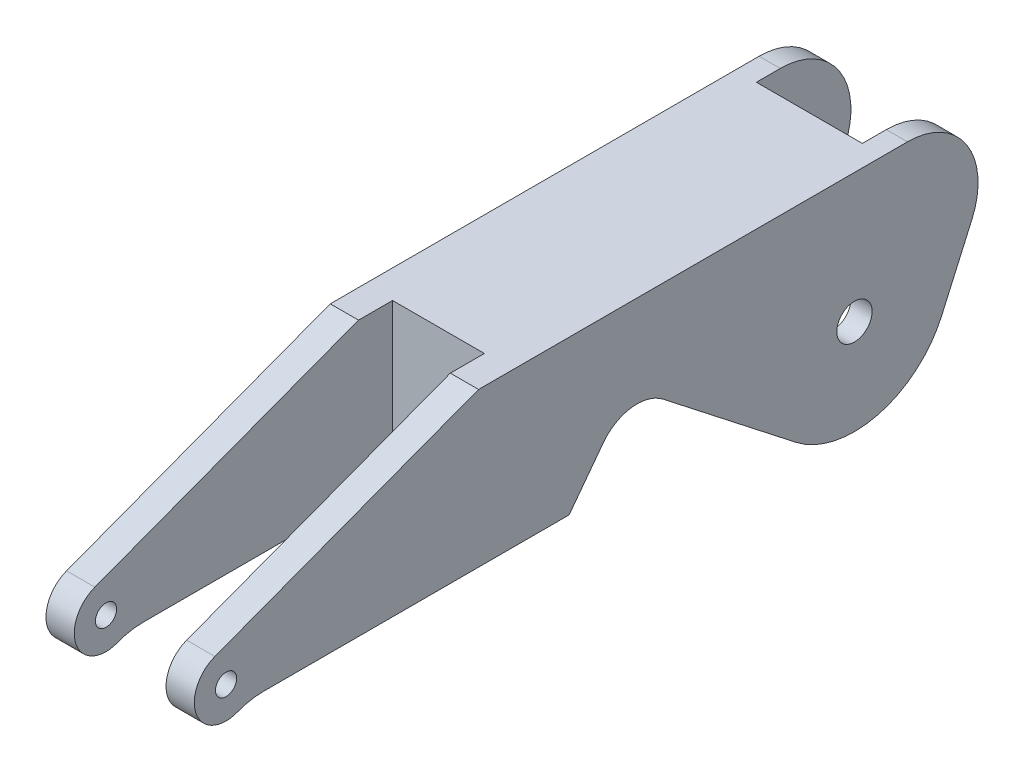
ISO-10303-21;
HEADER;
FILE_DESCRIPTION(('STEP AP214'),'2;1');
FILE_NAME('part.step','',(''),(''),'','','');
FILE_SCHEMA(('AUTOMOTIVE_DESIGN { 1 0 10303 214 1 1 1 1 }'));
ENDSEC;
DATA;
#1=APPLICATION_CONTEXT('core data for automotive mechanical design processes');
#2=APPLICATION_PROTOCOL_DEFINITION('international standard','automotive_design',2000,#1);
#3=PRODUCT_CONTEXT('',#1,'mechanical');
#4=PRODUCT('Part','Part','',(#3));
#5=PRODUCT_RELATED_PRODUCT_CATEGORY('part','',(#4));
#6=PRODUCT_DEFINITION_FORMATION('','',#4);
#7=PRODUCT_DEFINITION_CONTEXT('part definition',#1,'design');
#8=PRODUCT_DEFINITION('design','',#6,#7);
#9=PRODUCT_DEFINITION_SHAPE('','',#8);
#10=(LENGTH_UNIT() NAMED_UNIT(*) SI_UNIT(.MILLI.,.METRE.));
#11=(NAMED_UNIT(*) PLANE_ANGLE_UNIT() SI_UNIT($,.RADIAN.));
#12=(NAMED_UNIT(*) SI_UNIT($,.STERADIAN.) SOLID_ANGLE_UNIT());
#13=UNCERTAINTY_MEASURE_WITH_UNIT(LENGTH_MEASURE(1.E-05),#10,'distance_accuracy_value','');
#14=(GEOMETRIC_REPRESENTATION_CONTEXT(3) GLOBAL_UNCERTAINTY_ASSIGNED_CONTEXT((#13)) GLOBAL_UNIT_ASSIGNED_CONTEXT((#10,
#11,#12)) REPRESENTATION_CONTEXT('',''));
#15=CARTESIAN_POINT('',(0.,0.,0.));
#16=DIRECTION('',(0.,0.,1.));
#17=DIRECTION('',(1.,0.,0.));
#18=AXIS2_PLACEMENT_3D('',#15,#16,#17);
#19=CARTESIAN_POINT('',(105.000000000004,182.960614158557,532.214439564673));
#20=DIRECTION('',(0.,-0.935725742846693,-0.352728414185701));
#21=DIRECTION('',(0.,0.3527284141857,-0.935725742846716));
#22=AXIS2_PLACEMENT_3D('',#19,#20,#21);
#23=PLANE('',#22);
#24=DIRECTION('',(-1.,0.,0.));
#25=VECTOR('',#24,1.);
#26=CARTESIAN_POINT('',(105.000000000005,42.2160562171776,905.584717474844));
#27=LINE('',#26,#25);
#28=CARTESIAN_POINT('',(-64.999999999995,42.2160562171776,905.584717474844));
#29=VERTEX_POINT('',#28);
#30=CARTESIAN_POINT('',(-104.999999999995,42.2160562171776,905.584717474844));
#31=VERTEX_POINT('',#30);
#32=EDGE_CURVE('E386',#29,#31,#27,.T.);
#33=ORIENTED_EDGE('',*,*,#32,.F.);
#34=DIRECTION('',(0.,0.3527284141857,-0.935725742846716));
#35=VECTOR('',#34,1.);
#36=CARTESIAN_POINT('',(-64.9999999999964,182.960614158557,532.214439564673));
#37=LINE('',#36,#35);
#38=CARTESIAN_POINT('',(-64.9999999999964,182.960614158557,532.214439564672));
#39=VERTEX_POINT('',#38);
#40=EDGE_CURVE('E244',#29,#39,#37,.T.);
#41=ORIENTED_EDGE('',*,*,#40,.T.);
#42=DIRECTION('',(-1.,0.,0.));
#43=VECTOR('',#42,1.);
#44=CARTESIAN_POINT('',(105.000000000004,182.960614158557,532.214439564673));
#45=LINE('',#44,#43);
#46=CARTESIAN_POINT('',(-104.999999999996,182.960614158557,532.214439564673));
#47=VERTEX_POINT('',#46);
#48=EDGE_CURVE('E220',#39,#47,#45,.T.);
#49=ORIENTED_EDGE('',*,*,#48,.T.);
#50=DIRECTION('',(0.,-0.3527284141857,0.935725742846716));
#51=VECTOR('',#50,1.);
#52=CARTESIAN_POINT('',(-104.999999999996,182.960614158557,532.214439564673));
#53=LINE('',#52,#51);
#54=EDGE_CURVE('E366',#47,#31,#53,.T.);
#55=ORIENTED_EDGE('',*,*,#54,.T.);
#56=EDGE_LOOP('',(#33,#41,#49,#55));
#57=FACE_BOUND('',#56,.T.);
#58=ADVANCED_FACE('F16',(#57),#23,.F.);
#59=CARTESIAN_POINT('',(105.000000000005,0.100257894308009,889.737756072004));
#60=DIRECTION('',(-1.,0.,0.));
#61=DIRECTION('',(0.,0.,1.));
#62=AXIS2_PLACEMENT_3D('',#59,#60,#61);
#63=CYLINDRICAL_SURFACE('',#62,44.998518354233);
#64=DIRECTION('',(-1.,0.,0.));
#65=VECTOR('',#64,1.);
#66=CARTESIAN_POINT('',(105.000000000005,-41.8965517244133,873.578095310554));
#67=LINE('',#66,#65);
#68=CARTESIAN_POINT('',(-64.999999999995,-41.8965517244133,873.578095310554));
#69=VERTEX_POINT('',#68);
#70=CARTESIAN_POINT('',(-104.999999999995,-41.8965517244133,873.578095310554));
#71=VERTEX_POINT('',#70);
#72=EDGE_CURVE('E382',#69,#71,#67,.T.);
#73=ORIENTED_EDGE('',*,*,#72,.F.);
#74=CARTESIAN_POINT('',(-64.999999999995,0.100257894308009,889.737756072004));
#75=DIRECTION('',(-1.,0.,0.));
#76=DIRECTION('',(0.,0.,1.));
#77=AXIS2_PLACEMENT_3D('',#74,#75,#76);
#78=CIRCLE('',#77,44.998518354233);
#79=EDGE_CURVE('E241',#69,#29,#78,.T.);
#80=ORIENTED_EDGE('',*,*,#79,.T.);
#81=ORIENTED_EDGE('',*,*,#32,.T.);
#82=CARTESIAN_POINT('',(-104.999999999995,0.100257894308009,889.737756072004));
#83=DIRECTION('',(1.,0.,0.));
#84=DIRECTION('',(0.,0.,-1.));
#85=AXIS2_PLACEMENT_3D('',#82,#83,#84);
#86=CIRCLE('',#85,44.998518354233);
#87=EDGE_CURVE('E369',#31,#71,#86,.T.);
#88=ORIENTED_EDGE('',*,*,#87,.T.);
#89=EDGE_LOOP('',(#73,#80,#81,#88));
#90=FACE_BOUND('',#89,.T.);
#91=ADVANCED_FACE('F559',(#90),#63,.T.);
#92=CARTESIAN_POINT('',(105.000000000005,-135.000000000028,837.084973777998));
#93=DIRECTION('',(-1.,0.,0.));
#94=DIRECTION('',(0.,0.,1.));
#95=AXIS2_PLACEMENT_3D('',#92,#93,#94);
#96=CYLINDRICAL_SURFACE('',#95,100.);
#97=DIRECTION('',(-1.,0.,0.));
#98=VECTOR('',#97,1.);
#99=CARTESIAN_POINT('',(105.000000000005,-35.0000000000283,837.084973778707));
#100=LINE('',#99,#98);
#101=CARTESIAN_POINT('',(-64.999999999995,-35.0000000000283,837.084973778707));
#102=VERTEX_POINT('',#101);
#103=CARTESIAN_POINT('',(-104.999999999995,-35.0000000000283,837.084973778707));
#104=VERTEX_POINT('',#103);
#105=EDGE_CURVE('E378',#102,#104,#100,.T.);
#106=ORIENTED_EDGE('',*,*,#105,.F.);
#107=CARTESIAN_POINT('',(-64.999999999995,-135.000000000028,837.084973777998));
#108=DIRECTION('',(-1.,0.,0.));
#109=DIRECTION('',(0.,0.,1.));
#110=AXIS2_PLACEMENT_3D('',#107,#108,#109);
#111=CIRCLE('',#110,100.);
#112=EDGE_CURVE('E238',#102,#69,#111,.F.);
#113=ORIENTED_EDGE('',*,*,#112,.T.);
#114=ORIENTED_EDGE('',*,*,#72,.T.);
#115=CARTESIAN_POINT('',(-104.999999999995,-135.000000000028,837.084973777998));
#116=DIRECTION('',(-1.,0.,0.));
#117=DIRECTION('',(0.,0.,-1.));
#118=AXIS2_PLACEMENT_3D('',#115,#116,#117);
#119=CIRCLE('',#118,100.);
#120=EDGE_CURVE('E372',#71,#104,#119,.T.);
#121=ORIENTED_EDGE('',*,*,#120,.T.);
#122=EDGE_LOOP('',(#106,#113,#114,#121));
#123=FACE_BOUND('',#122,.T.);
#124=ADVANCED_FACE('F565',(#123),#96,.F.);
#125=CARTESIAN_POINT('',(-74.9999999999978,-6.36125925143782,307.291190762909));
#126=DIRECTION('',(1.,0.,0.));
#127=DIRECTION('',(0.,0.,-1.));
#128=AXIS2_PLACEMENT_3D('',#125,#126,#127);
#129=PLANE('',#128);
#130=CARTESIAN_POINT('',(-75.,1.94289029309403E-11,5.27355936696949E-12));
#131=DIRECTION('',(1.,0.,0.));
#132=DIRECTION('',(0.,0.,-1.));
#133=AXIS2_PLACEMENT_3D('',#130,#131,#132);
#134=CIRCLE('',#133,25.);
#135=CARTESIAN_POINT('',(-75.0000000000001,1.94598966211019E-11,-24.9999999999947));
#136=VERTEX_POINT('',#135);
#137=EDGE_CURVE('E221',#136,#136,#134,.T.);
#138=ORIENTED_EDGE('',*,*,#137,.F.);
#139=EDGE_LOOP('',(#138));
#140=FACE_BOUND('',#139,.T.);
#141=CARTESIAN_POINT('',(-74.9999999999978,-6.99586439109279,307.778203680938));
#142=DIRECTION('',(1.,0.,0.));
#143=DIRECTION('',(0.,0.,-1.));
#144=AXIS2_PLACEMENT_3D('',#141,#142,#143);
#145=CIRCLE('',#144,60.);
#146=CARTESIAN_POINT('',(-74.9999999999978,29.849299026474,355.132548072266));
#147=VERTEX_POINT('',#146);
#148=CARTESIAN_POINT('',(-74.9999999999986,40.2903326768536,270.845622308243));
#149=VERTEX_POINT('',#148);
#150=EDGE_CURVE('E319',#147,#149,#145,.F.);
#151=ORIENTED_EDGE('',*,*,#150,.T.);
#152=DIRECTION('',(0.,-0.615661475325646,-0.788010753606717));
#153=VECTOR('',#152,1.);
#154=CARTESIAN_POINT('',(-74.9999999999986,40.2903326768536,270.845622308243));
#155=LINE('',#154,#153);
#156=CARTESIAN_POINT('',(-75.,-106.381451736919,83.1142991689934));
#157=VERTEX_POINT('',#156);
#158=EDGE_CURVE('E317',#149,#157,#155,.T.);
#159=ORIENTED_EDGE('',*,*,#158,.T.);
#160=CARTESIAN_POINT('',(-75.,1.94289029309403E-11,5.27355936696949E-12));
#161=DIRECTION('',(1.,0.,0.));
#162=DIRECTION('',(0.,0.,-1.));
#163=AXIS2_PLACEMENT_3D('',#160,#161,#162);
#164=CIRCLE('',#163,135.000000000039);
#165=CARTESIAN_POINT('',(-75.,-54.7057766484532,-123.419115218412));
#166=VERTEX_POINT('',#165);
#167=EDGE_CURVE('E315',#157,#166,#164,.T.);
#168=ORIENTED_EDGE('',*,*,#167,.T.);
#169=DIRECTION('',(0.,0.914215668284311,-0.405227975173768));
#170=VECTOR('',#169,1.);
#171=CARTESIAN_POINT('',(-75.,-54.7057766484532,-123.419115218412));
#172=LINE('',#171,#170);
#173=CARTESIAN_POINT('',(-75.,42.4378166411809,-166.478212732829));
#174=VERTEX_POINT('',#173);
#175=EDGE_CURVE('E313',#166,#174,#172,.T.);
#176=ORIENTED_EDGE('',*,*,#175,.T.);
#177=CARTESIAN_POINT('',(-75.,82.9606141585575,-75.0566459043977));
#178=DIRECTION('',(1.,0.,0.));
#179=DIRECTION('',(0.,0.,-1.));
#180=AXIS2_PLACEMENT_3D('',#177,#178,#179);
#181=CIRCLE('',#180,100.);
#182=CARTESIAN_POINT('',(-75.,182.960614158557,-75.0566459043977));
#183=VERTEX_POINT('',#182);
#184=EDGE_CURVE('E311',#174,#183,#181,.T.);
#185=ORIENTED_EDGE('',*,*,#184,.T.);
#186=DIRECTION('',(0.,0.,1.));
#187=VECTOR('',#186,1.);
#188=CARTESIAN_POINT('',(-75.,182.960614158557,-75.0566459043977));
#189=LINE('',#188,#187);
#190=CARTESIAN_POINT('',(-75.,182.960614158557,-41.1935654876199));
#191=VERTEX_POINT('',#190);
#192=EDGE_CURVE('E309',#183,#191,#189,.T.);
#193=ORIENTED_EDGE('',*,*,#192,.T.);
#194=DIRECTION('',(0.,-0.486587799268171,0.873631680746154));
#195=VECTOR('',#194,1.);
#196=CARTESIAN_POINT('',(-75.,188.459390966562,-51.0662043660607));
#197=LINE('',#196,#195);
#198=CARTESIAN_POINT('',(-75.,168.535296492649,-15.2939960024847));
#199=VERTEX_POINT('',#198);
#200=EDGE_CURVE('E252',#191,#199,#197,.T.);
#201=ORIENTED_EDGE('',*,*,#200,.T.);
#202=DIRECTION('',(0.,-0.0649569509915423,0.997888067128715));
#203=VECTOR('',#202,1.);
#204=CARTESIAN_POINT('',(-75.,168.535296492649,-15.2939960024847));
#205=LINE('',#204,#203);
#206=CARTESIAN_POINT('',(-75.,155.750781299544,181.105541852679));
#207=VERTEX_POINT('',#206);
#208=EDGE_CURVE('E254',#199,#207,#205,.T.);
#209=ORIENTED_EDGE('',*,*,#208,.T.);
#210=DIRECTION('',(0.,-0.896674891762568,0.4426896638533));
#211=VECTOR('',#210,1.);
#212=CARTESIAN_POINT('',(-75.,155.750781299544,181.105541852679));
#213=LINE('',#212,#211);
#214=CARTESIAN_POINT('',(-74.9999999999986,22.5074664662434,246.887955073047));
#215=VERTEX_POINT('',#214);
#216=EDGE_CURVE('E258',#207,#215,#213,.T.);
#217=ORIENTED_EDGE('',*,*,#216,.T.);
#218=DIRECTION('',(0.,0.617333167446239,0.786701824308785));
#219=VECTOR('',#218,1.);
#220=CARTESIAN_POINT('',(-74.9999999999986,22.5074664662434,246.887955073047));
#221=LINE('',#220,#219);
#222=CARTESIAN_POINT('',(-74.9999999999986,40.840850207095,270.251200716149));
#223=VERTEX_POINT('',#222);
#224=EDGE_CURVE('E261',#215,#223,#221,.T.);
#225=ORIENTED_EDGE('',*,*,#224,.T.);
#226=CARTESIAN_POINT('',(-74.9999999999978,-6.36125925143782,307.291190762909));
#227=DIRECTION('',(1.,0.,0.));
#228=DIRECTION('',(0.,0.,-1.));
#229=AXIS2_PLACEMENT_3D('',#226,#227,#228);
#230=CIRCLE('',#229,60.);
#231=EDGE_CURVE('E264',#223,#147,#230,.T.);
#232=ORIENTED_EDGE('',*,*,#231,.T.);
#233=EDGE_LOOP('',(#151,#159,#168,#176,#185,#193,#201,#209,#217,#225,#232));
#234=FACE_BOUND('',#233,.T.);
#235=CARTESIAN_POINT('',(-75.,121.700000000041,28.3999999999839));
#236=DIRECTION('',(1.,0.,0.));
#237=DIRECTION('',(0.,0.,-1.));
#238=AXIS2_PLACEMENT_3D('',#235,#236,#237);
#239=CIRCLE('',#238,15.);
#240=CARTESIAN_POINT('',(-75.0000000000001,121.700000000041,13.3999999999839));
#241=VERTEX_POINT('',#240);
#242=EDGE_CURVE('E246',#241,#241,#239,.T.);
#243=ORIENTED_EDGE('',*,*,#242,.F.);
#244=EDGE_LOOP('',(#243));
#245=FACE_BOUND('',#244,.T.);
#246=ADVANCED_FACE('F507',(#140,#234,#245),#129,.T.);
#247=CARTESIAN_POINT('',(105.000000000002,-6.99586439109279,307.778203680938));
#248=DIRECTION('',(-1.,0.,0.));
#249=DIRECTION('',(0.,0.,1.));
#250=AXIS2_PLACEMENT_3D('',#247,#248,#249);
#251=CYLINDRICAL_SURFACE('',#250,60.);
#252=ORIENTED_EDGE('',*,*,#150,.F.);
#253=DIRECTION('',(-1.,0.,0.));
#254=VECTOR('',#253,1.);
#255=CARTESIAN_POINT('',(105.000000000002,29.8492990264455,355.132548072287));
#256=LINE('',#255,#254);
#257=CARTESIAN_POINT('',(-104.999999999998,29.8492990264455,355.132548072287));
#258=VERTEX_POINT('',#257);
#259=EDGE_CURVE('E413',#147,#258,#256,.T.);
#260=ORIENTED_EDGE('',*,*,#259,.T.);
#261=CARTESIAN_POINT('',(-104.999999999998,-6.99586439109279,307.778203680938));
#262=DIRECTION('',(-1.,0.,0.));
#263=DIRECTION('',(0.,0.,-1.));
#264=AXIS2_PLACEMENT_3D('',#261,#262,#263);
#265=CIRCLE('',#264,60.);
#266=CARTESIAN_POINT('',(-104.999999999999,40.2903326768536,270.845622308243));
#267=VERTEX_POINT('',#266);
#268=EDGE_CURVE('E349',#258,#267,#265,.T.);
#269=ORIENTED_EDGE('',*,*,#268,.T.);
#270=DIRECTION('',(-1.,0.,0.));
#271=VECTOR('',#270,1.);
#272=CARTESIAN_POINT('',(105.000000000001,40.2903326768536,270.845622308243));
#273=LINE('',#272,#271);
#274=EDGE_CURVE('E409',#149,#267,#273,.T.);
#275=ORIENTED_EDGE('',*,*,#274,.F.);
#276=EDGE_LOOP('',(#252,#260,#269,#275));
#277=FACE_BOUND('',#276,.T.);
#278=ADVANCED_FACE('F504',(#277),#251,.F.);
#279=CARTESIAN_POINT('',(105.000000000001,40.2903326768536,270.845622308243));
#280=DIRECTION('',(0.,0.788010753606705,-0.615661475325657));
#281=DIRECTION('',(0.,0.615661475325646,0.788010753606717));
#282=AXIS2_PLACEMENT_3D('',#279,#280,#281);
#283=PLANE('',#282);
#284=ORIENTED_EDGE('',*,*,#158,.F.);
#285=ORIENTED_EDGE('',*,*,#274,.T.);
#286=DIRECTION('',(0.,-0.615661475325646,-0.788010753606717));
#287=VECTOR('',#286,1.);
#288=CARTESIAN_POINT('',(-104.999999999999,40.2903326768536,270.845622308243));
#289=LINE('',#288,#287);
#290=CARTESIAN_POINT('',(-105.,-106.381451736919,83.1142991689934));
#291=VERTEX_POINT('',#290);
#292=EDGE_CURVE('E352',#267,#291,#289,.T.);
#293=ORIENTED_EDGE('',*,*,#292,.T.);
#294=DIRECTION('',(-1.,0.,0.));
#295=VECTOR('',#294,1.);
#296=CARTESIAN_POINT('',(105.,-106.381451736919,83.1142991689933));
#297=LINE('',#296,#295);
#298=EDGE_CURVE('E405',#157,#291,#297,.T.);
#299=ORIENTED_EDGE('',*,*,#298,.F.);
#300=EDGE_LOOP('',(#284,#285,#293,#299));
#301=FACE_BOUND('',#300,.T.);
#302=ADVANCED_FACE('F513',(#301),#283,.F.);
#303=CARTESIAN_POINT('',(105.,1.94289029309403E-11,5.27355936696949E-12));
#304=DIRECTION('',(-1.,0.,0.));
#305=DIRECTION('',(0.,0.,1.));
#306=AXIS2_PLACEMENT_3D('',#303,#304,#305);
#307=CYLINDRICAL_SURFACE('',#306,135.000000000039);
#308=ORIENTED_EDGE('',*,*,#167,.F.);
#309=ORIENTED_EDGE('',*,*,#298,.T.);
#310=CARTESIAN_POINT('',(-105.,1.94289029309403E-11,5.27355936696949E-12));
#311=DIRECTION('',(1.,0.,0.));
#312=DIRECTION('',(0.,0.,-1.));
#313=AXIS2_PLACEMENT_3D('',#310,#311,#312);
#314=CIRCLE('',#313,135.000000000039);
#315=CARTESIAN_POINT('',(-105.,-54.7057766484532,-123.419115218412));
#316=VERTEX_POINT('',#315);
#317=EDGE_CURVE('E355',#291,#316,#314,.T.);
#318=ORIENTED_EDGE('',*,*,#317,.T.);
#319=DIRECTION('',(-1.,0.,0.));
#320=VECTOR('',#319,1.);
#321=CARTESIAN_POINT('',(105.,-54.7057766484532,-123.41911521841));
#322=LINE('',#321,#320);
#323=EDGE_CURVE('E401',#166,#316,#322,.T.);
#324=ORIENTED_EDGE('',*,*,#323,.F.);
#325=EDGE_LOOP('',(#308,#309,#318,#324));
#326=FACE_BOUND('',#325,.T.);
#327=ADVANCED_FACE('F515',(#326),#307,.T.);
#328=CARTESIAN_POINT('',(105.,-54.7057766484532,-123.41911521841));
#329=DIRECTION('',(0.,0.405227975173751,0.914215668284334));
#330=DIRECTION('',(0.,-0.914215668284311,0.405227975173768));
#331=AXIS2_PLACEMENT_3D('',#328,#329,#330);
#332=PLANE('',#331);
#333=ORIENTED_EDGE('',*,*,#175,.F.);
#334=ORIENTED_EDGE('',*,*,#323,.T.);
#335=DIRECTION('',(0.,0.914215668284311,-0.405227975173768));
#336=VECTOR('',#335,1.);
#337=CARTESIAN_POINT('',(-105.,-54.7057766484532,-123.419115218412));
#338=LINE('',#337,#336);
#339=CARTESIAN_POINT('',(-105.,42.4378166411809,-166.478212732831));
#340=VERTEX_POINT('',#339);
#341=EDGE_CURVE('E358',#316,#340,#338,.T.);
#342=ORIENTED_EDGE('',*,*,#341,.T.);
#343=DIRECTION('',(-1.,0.,0.));
#344=VECTOR('',#343,1.);
#345=CARTESIAN_POINT('',(105.,42.4378166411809,-166.478212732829));
#346=LINE('',#345,#344);
#347=EDGE_CURVE('E397',#174,#340,#346,.T.);
#348=ORIENTED_EDGE('',*,*,#347,.F.);
#349=EDGE_LOOP('',(#333,#334,#342,#348));
#350=FACE_BOUND('',#349,.T.);
#351=ADVANCED_FACE('F522',(#350),#332,.F.);
#352=CARTESIAN_POINT('',(105.,82.9606141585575,-75.0566459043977));
#353=DIRECTION('',(-1.,0.,0.));
#354=DIRECTION('',(0.,0.,1.));
#355=AXIS2_PLACEMENT_3D('',#352,#353,#354);
#356=CYLINDRICAL_SURFACE('',#355,100.);
#357=ORIENTED_EDGE('',*,*,#184,.F.);
#358=ORIENTED_EDGE('',*,*,#347,.T.);
#359=CARTESIAN_POINT('',(-105.,82.9606141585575,-75.0566459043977));
#360=DIRECTION('',(1.,0.,0.));
#361=DIRECTION('',(0.,0.,-1.));
#362=AXIS2_PLACEMENT_3D('',#359,#360,#361);
#363=CIRCLE('',#362,100.);
#364=CARTESIAN_POINT('',(-105.,182.960614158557,-75.0566459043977));
#365=VERTEX_POINT('',#364);
#366=EDGE_CURVE('E361',#340,#365,#363,.T.);
#367=ORIENTED_EDGE('',*,*,#366,.T.);
#368=DIRECTION('',(-1.,0.,0.));
#369=VECTOR('',#368,1.);
#370=CARTESIAN_POINT('',(105.,182.960614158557,-75.0566459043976));
#371=LINE('',#370,#369);
#372=EDGE_CURVE('E393',#183,#365,#371,.T.);
#373=ORIENTED_EDGE('',*,*,#372,.F.);
#374=EDGE_LOOP('',(#357,#358,#367,#373));
#375=FACE_BOUND('',#374,.T.);
#376=ADVANCED_FACE('F525',(#375),#356,.T.);
#377=CARTESIAN_POINT('',(105.,182.960614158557,-75.0566459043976));
#378=DIRECTION('',(0.,-0.999999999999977,0.));
#379=DIRECTION('',(0.,0.,-1.));
#380=AXIS2_PLACEMENT_3D('',#377,#378,#379);
#381=PLANE('',#380);
#382=ORIENTED_EDGE('',*,*,#48,.F.);
#383=DIRECTION('',(0.,0.,-1.));
#384=VECTOR('',#383,1.);
#385=CARTESIAN_POINT('',(-64.9999999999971,182.960614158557,484.000000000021));
#386=LINE('',#385,#384);
#387=CARTESIAN_POINT('',(-64.9999999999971,182.960614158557,484.000000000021));
#388=VERTEX_POINT('',#387);
#389=EDGE_CURVE('E203',#39,#388,#386,.T.);
#390=ORIENTED_EDGE('',*,*,#389,.T.);
#391=DIRECTION('',(1.,0.,0.));
#392=VECTOR('',#391,1.);
#393=CARTESIAN_POINT('',(-64.9999999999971,182.960614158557,484.000000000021));
#394=LINE('',#393,#392);
#395=CARTESIAN_POINT('',(65.0000000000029,182.960614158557,484.000000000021));
#396=VERTEX_POINT('',#395);
#397=EDGE_CURVE('E210',#388,#396,#394,.T.);
#398=ORIENTED_EDGE('',*,*,#397,.T.);
#399=DIRECTION('',(0.,0.,1.));
#400=VECTOR('',#399,1.);
#401=CARTESIAN_POINT('',(65.0000000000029,182.960614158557,484.000000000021));
#402=LINE('',#401,#400);
#403=CARTESIAN_POINT('',(65.0000000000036,182.960614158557,532.214439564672));
#404=VERTEX_POINT('',#403);
#405=EDGE_CURVE('E207',#396,#404,#402,.T.);
#406=ORIENTED_EDGE('',*,*,#405,.T.);
#407=CARTESIAN_POINT('',(105.000000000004,182.960614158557,532.214439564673));
#408=VERTEX_POINT('',#407);
#409=EDGE_CURVE('E390',#408,#404,#45,.T.);
#410=ORIENTED_EDGE('',*,*,#409,.F.);
#411=DIRECTION('',(0.,0.,1.));
#412=VECTOR('',#411,1.);
#413=CARTESIAN_POINT('',(105.,182.960614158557,-75.0566459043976));
#414=LINE('',#413,#412);
#415=CARTESIAN_POINT('',(105.,182.960614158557,-75.0566459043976));
#416=VERTEX_POINT('',#415);
#417=EDGE_CURVE('E336',#416,#408,#414,.T.);
#418=ORIENTED_EDGE('',*,*,#417,.F.);
#419=CARTESIAN_POINT('',(75.,182.960614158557,-75.0566459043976));
#420=VERTEX_POINT('',#419);
#421=EDGE_CURVE('E394',#416,#420,#371,.T.);
#422=ORIENTED_EDGE('',*,*,#421,.T.);
#423=DIRECTION('',(0.,0.,1.));
#424=VECTOR('',#423,1.);
#425=CARTESIAN_POINT('',(75.,182.960614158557,-75.0566459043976));
#426=LINE('',#425,#424);
#427=CARTESIAN_POINT('',(75.,182.960614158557,-41.1935654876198));
#428=VERTEX_POINT('',#427);
#429=EDGE_CURVE('E283',#420,#428,#426,.T.);
#430=ORIENTED_EDGE('',*,*,#429,.T.);
#431=DIRECTION('',(-1.,0.,0.));
#432=VECTOR('',#431,1.);
#433=CARTESIAN_POINT('',(105.,182.960614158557,-41.1935654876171));
#434=LINE('',#433,#432);
#435=EDGE_CURVE('E417',#428,#191,#434,.T.);
#436=ORIENTED_EDGE('',*,*,#435,.T.);
#437=ORIENTED_EDGE('',*,*,#192,.F.);
#438=ORIENTED_EDGE('',*,*,#372,.T.);
#439=DIRECTION('',(0.,0.,1.));
#440=VECTOR('',#439,1.);
#441=CARTESIAN_POINT('',(-105.,182.960614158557,-75.0566459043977));
#442=LINE('',#441,#440);
#443=EDGE_CURVE('E364',#365,#47,#442,.T.);
#444=ORIENTED_EDGE('',*,*,#443,.T.);
#445=EDGE_LOOP('',(#382,#390,#398,#406,#410,#418,#422,#430,#436,#437,#438,#444));
#446=FACE_BOUND('',#445,.T.);
#447=ADVANCED_FACE('F218',(#446),#381,.F.);
#448=CARTESIAN_POINT('',(105.000000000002,-35.0000000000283,404.000000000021));
#449=DIRECTION('',(0.,0.601815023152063,0.798635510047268));
#450=DIRECTION('',(0.,-0.798635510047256,0.601815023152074));
#451=AXIS2_PLACEMENT_3D('',#448,#449,#450);
#452=PLANE('',#451);
#453=DIRECTION('',(-1.,0.,0.));
#454=VECTOR('',#453,1.);
#455=CARTESIAN_POINT('',(105.000000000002,-35.0000000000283,404.000000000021));
#456=LINE('',#455,#454);
#457=CARTESIAN_POINT('',(105.000000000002,-35.0000000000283,404.000000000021));
#458=VERTEX_POINT('',#457);
#459=CARTESIAN_POINT('',(-104.999999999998,-35.0000000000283,404.000000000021));
#460=VERTEX_POINT('',#459);
#461=EDGE_CURVE('E346',#458,#460,#456,.T.);
#462=ORIENTED_EDGE('',*,*,#461,.T.);
#463=DIRECTION('',(0.,0.798635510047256,-0.601815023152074));
#464=VECTOR('',#463,1.);
#465=CARTESIAN_POINT('',(-104.999999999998,-35.0000000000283,404.000000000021));
#466=LINE('',#465,#464);
#467=EDGE_CURVE('E321',#460,#258,#466,.T.);
#468=ORIENTED_EDGE('',*,*,#467,.T.);
#469=ORIENTED_EDGE('',*,*,#259,.F.);
#470=DIRECTION('',(1.,0.,0.));
#471=VECTOR('',#470,1.);
#472=CARTESIAN_POINT('',(-74.9999999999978,29.849299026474,355.132548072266));
#473=LINE('',#472,#471);
#474=CARTESIAN_POINT('',(75.0000000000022,29.849299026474,355.132548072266));
#475=VERTEX_POINT('',#474);
#476=EDGE_CURVE('E280',#147,#475,#473,.T.);
#477=ORIENTED_EDGE('',*,*,#476,.T.);
#478=CARTESIAN_POINT('',(105.000000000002,29.8492990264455,355.132548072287));
#479=VERTEX_POINT('',#478);
#480=EDGE_CURVE('E414',#479,#475,#256,.T.);
#481=ORIENTED_EDGE('',*,*,#480,.F.);
#482=DIRECTION('',(0.,0.798635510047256,-0.601815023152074));
#483=VECTOR('',#482,1.);
#484=CARTESIAN_POINT('',(105.000000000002,-35.0000000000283,404.000000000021));
#485=LINE('',#484,#483);
#486=EDGE_CURVE('E322',#458,#479,#485,.T.);
#487=ORIENTED_EDGE('',*,*,#486,.F.);
#488=EDGE_LOOP('',(#462,#468,#469,#477,#481,#487));
#489=FACE_BOUND('',#488,.T.);
#490=ADVANCED_FACE('F18',(#489),#452,.F.);
#491=ORIENTED_EDGE('',*,*,#480,.T.);
#492=CARTESIAN_POINT('',(75.0000000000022,-6.99586439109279,307.778203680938));
#493=DIRECTION('',(1.,0.,0.));
#494=DIRECTION('',(0.,0.,-1.));
#495=AXIS2_PLACEMENT_3D('',#492,#493,#494);
#496=CIRCLE('',#495,60.);
#497=CARTESIAN_POINT('',(75.0000000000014,40.2903326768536,270.845622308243));
#498=VERTEX_POINT('',#497);
#499=EDGE_CURVE('E306',#475,#498,#496,.F.);
#500=ORIENTED_EDGE('',*,*,#499,.T.);
#501=CARTESIAN_POINT('',(105.000000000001,40.2903326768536,270.845622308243));
#502=VERTEX_POINT('',#501);
#503=EDGE_CURVE('E410',#502,#498,#273,.T.);
#504=ORIENTED_EDGE('',*,*,#503,.F.);
#505=CARTESIAN_POINT('',(105.000000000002,-6.99586439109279,307.778203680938));
#506=DIRECTION('',(-1.,0.,0.));
#507=DIRECTION('',(0.,0.,-1.));
#508=AXIS2_PLACEMENT_3D('',#505,#506,#507);
#509=CIRCLE('',#508,60.);
#510=EDGE_CURVE('E325',#479,#502,#509,.T.);
#511=ORIENTED_EDGE('',*,*,#510,.F.);
#512=EDGE_LOOP('',(#491,#500,#504,#511));
#513=FACE_BOUND('',#512,.T.);
#514=ADVANCED_FACE('F461',(#513),#251,.F.);
#515=ORIENTED_EDGE('',*,*,#503,.T.);
#516=DIRECTION('',(0.,-0.615661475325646,-0.788010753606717));
#517=VECTOR('',#516,1.);
#518=CARTESIAN_POINT('',(75.0000000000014,40.2903326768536,270.845622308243));
#519=LINE('',#518,#517);
#520=CARTESIAN_POINT('',(75.,-106.381451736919,83.1142991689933));
#521=VERTEX_POINT('',#520);
#522=EDGE_CURVE('E303',#498,#521,#519,.T.);
#523=ORIENTED_EDGE('',*,*,#522,.T.);
#524=CARTESIAN_POINT('',(105.,-106.381451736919,83.1142991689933));
#525=VERTEX_POINT('',#524);
#526=EDGE_CURVE('E406',#525,#521,#297,.T.);
#527=ORIENTED_EDGE('',*,*,#526,.F.);
#528=DIRECTION('',(0.,-0.615661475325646,-0.788010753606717));
#529=VECTOR('',#528,1.);
#530=CARTESIAN_POINT('',(105.000000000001,40.2903326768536,270.845622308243));
#531=LINE('',#530,#529);
#532=EDGE_CURVE('E328',#502,#525,#531,.T.);
#533=ORIENTED_EDGE('',*,*,#532,.F.);
#534=EDGE_LOOP('',(#515,#523,#527,#533));
#535=FACE_BOUND('',#534,.T.);
#536=ADVANCED_FACE('F465',(#535),#283,.F.);
#537=ORIENTED_EDGE('',*,*,#526,.T.);
#538=CARTESIAN_POINT('',(75.,1.94289029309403E-11,5.27355936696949E-12));
#539=DIRECTION('',(1.,0.,0.));
#540=DIRECTION('',(0.,0.,-1.));
#541=AXIS2_PLACEMENT_3D('',#538,#539,#540);
#542=CIRCLE('',#541,135.000000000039);
#543=CARTESIAN_POINT('',(75.,-54.7057766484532,-123.41911521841));
#544=VERTEX_POINT('',#543);
#545=EDGE_CURVE('E300',#521,#544,#542,.T.);
#546=ORIENTED_EDGE('',*,*,#545,.T.);
#547=CARTESIAN_POINT('',(105.,-54.7057766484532,-123.41911521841));
#548=VERTEX_POINT('',#547);
#549=EDGE_CURVE('E402',#548,#544,#322,.T.);
#550=ORIENTED_EDGE('',*,*,#549,.F.);
#551=CARTESIAN_POINT('',(105.,1.94289029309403E-11,5.27355936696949E-12));
#552=DIRECTION('',(1.,0.,0.));
#553=DIRECTION('',(0.,0.,-1.));
#554=AXIS2_PLACEMENT_3D('',#551,#552,#553);
#555=CIRCLE('',#554,135.000000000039);
#556=EDGE_CURVE('E330',#525,#548,#555,.T.);
#557=ORIENTED_EDGE('',*,*,#556,.F.);
#558=EDGE_LOOP('',(#537,#546,#550,#557));
#559=FACE_BOUND('',#558,.T.);
#560=ADVANCED_FACE('F471',(#559),#307,.T.);
#561=ORIENTED_EDGE('',*,*,#549,.T.);
#562=DIRECTION('',(0.,0.914215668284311,-0.405227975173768));
#563=VECTOR('',#562,1.);
#564=CARTESIAN_POINT('',(75.,-54.7057766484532,-123.41911521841));
#565=LINE('',#564,#563);
#566=CARTESIAN_POINT('',(75.,42.4378166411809,-166.478212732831));
#567=VERTEX_POINT('',#566);
#568=EDGE_CURVE('E297',#544,#567,#565,.T.);
#569=ORIENTED_EDGE('',*,*,#568,.T.);
#570=CARTESIAN_POINT('',(105.,42.4378166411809,-166.478212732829));
#571=VERTEX_POINT('',#570);
#572=EDGE_CURVE('E398',#571,#567,#346,.T.);
#573=ORIENTED_EDGE('',*,*,#572,.F.);
#574=DIRECTION('',(0.,0.914215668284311,-0.405227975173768));
#575=VECTOR('',#574,1.);
#576=CARTESIAN_POINT('',(105.,-54.7057766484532,-123.41911521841));
#577=LINE('',#576,#575);
#578=EDGE_CURVE('E332',#548,#571,#577,.T.);
#579=ORIENTED_EDGE('',*,*,#578,.F.);
#580=EDGE_LOOP('',(#561,#569,#573,#579));
#581=FACE_BOUND('',#580,.T.);
#582=ADVANCED_FACE('F473',(#581),#332,.F.);
#583=ORIENTED_EDGE('',*,*,#572,.T.);
#584=CARTESIAN_POINT('',(75.,82.9606141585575,-75.0566459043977));
#585=DIRECTION('',(1.,0.,0.));
#586=DIRECTION('',(0.,0.,-1.));
#587=AXIS2_PLACEMENT_3D('',#584,#585,#586);
#588=CIRCLE('',#587,100.);
#589=EDGE_CURVE('E294',#567,#420,#588,.T.);
#590=ORIENTED_EDGE('',*,*,#589,.T.);
#591=ORIENTED_EDGE('',*,*,#421,.F.);
#592=CARTESIAN_POINT('',(105.,82.9606141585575,-75.0566459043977));
#593=DIRECTION('',(1.,0.,0.));
#594=DIRECTION('',(0.,0.,-1.));
#595=AXIS2_PLACEMENT_3D('',#592,#593,#594);
#596=CIRCLE('',#595,100.);
#597=EDGE_CURVE('E334',#571,#416,#596,.T.);
#598=ORIENTED_EDGE('',*,*,#597,.F.);
#599=EDGE_LOOP('',(#583,#590,#591,#598));
#600=FACE_BOUND('',#599,.T.);
#601=ADVANCED_FACE('F477',(#600),#356,.T.);
#602=ORIENTED_EDGE('',*,*,#409,.T.);
#603=DIRECTION('',(0.,-0.3527284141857,0.935725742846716));
#604=VECTOR('',#603,1.);
#605=CARTESIAN_POINT('',(65.0000000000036,182.960614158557,532.214439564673));
#606=LINE('',#605,#604);
#607=CARTESIAN_POINT('',(65.0000000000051,42.2160562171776,905.584717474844));
#608=VERTEX_POINT('',#607);
#609=EDGE_CURVE('E235',#404,#608,#606,.T.);
#610=ORIENTED_EDGE('',*,*,#609,.T.);
#611=CARTESIAN_POINT('',(105.000000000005,42.2160562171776,905.584717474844));
#612=VERTEX_POINT('',#611);
#613=EDGE_CURVE('E387',#612,#608,#27,.T.);
#614=ORIENTED_EDGE('',*,*,#613,.F.);
#615=DIRECTION('',(0.,-0.3527284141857,0.935725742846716));
#616=VECTOR('',#615,1.);
#617=CARTESIAN_POINT('',(105.000000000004,182.960614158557,532.214439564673));
#618=LINE('',#617,#616);
#619=EDGE_CURVE('E338',#408,#612,#618,.T.);
#620=ORIENTED_EDGE('',*,*,#619,.F.);
#621=EDGE_LOOP('',(#602,#610,#614,#620));
#622=FACE_BOUND('',#621,.T.);
#623=ADVANCED_FACE('F483',(#622),#23,.F.);
#624=CARTESIAN_POINT('',(65.0000000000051,0.100257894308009,889.737756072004));
#625=DIRECTION('',(1.,0.,0.));
#626=DIRECTION('',(0.,0.,-1.));
#627=AXIS2_PLACEMENT_3D('',#624,#625,#626);
#628=CIRCLE('',#627,44.998518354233);
#629=CARTESIAN_POINT('',(65.0000000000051,-41.8965517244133,873.578095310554));
#630=VERTEX_POINT('',#629);
#631=EDGE_CURVE('E233',#608,#630,#628,.T.);
#632=ORIENTED_EDGE('',*,*,#631,.T.);
#633=CARTESIAN_POINT('',(105.000000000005,-41.8965517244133,873.578095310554));
#634=VERTEX_POINT('',#633);
#635=EDGE_CURVE('E383',#634,#630,#67,.T.);
#636=ORIENTED_EDGE('',*,*,#635,.F.);
#637=CARTESIAN_POINT('',(105.000000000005,0.100257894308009,889.737756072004));
#638=DIRECTION('',(1.,0.,0.));
#639=DIRECTION('',(0.,0.,-1.));
#640=AXIS2_PLACEMENT_3D('',#637,#638,#639);
#641=CIRCLE('',#640,44.998518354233);
#642=EDGE_CURVE('E340',#612,#634,#641,.T.);
#643=ORIENTED_EDGE('',*,*,#642,.F.);
#644=ORIENTED_EDGE('',*,*,#613,.T.);
#645=EDGE_LOOP('',(#632,#636,#643,#644));
#646=FACE_BOUND('',#645,.T.);
#647=ADVANCED_FACE('F487',(#646),#63,.T.);
#648=ORIENTED_EDGE('',*,*,#635,.T.);
#649=CARTESIAN_POINT('',(65.0000000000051,-135.000000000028,837.084973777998));
#650=DIRECTION('',(1.,0.,0.));
#651=DIRECTION('',(0.,0.,-1.));
#652=AXIS2_PLACEMENT_3D('',#649,#650,#651);
#653=CIRCLE('',#652,100.);
#654=CARTESIAN_POINT('',(65.0000000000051,-35.0000000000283,837.084973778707));
#655=VERTEX_POINT('',#654);
#656=EDGE_CURVE('E229',#630,#655,#653,.F.);
#657=ORIENTED_EDGE('',*,*,#656,.T.);
#658=CARTESIAN_POINT('',(105.000000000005,-35.0000000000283,837.084973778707));
#659=VERTEX_POINT('',#658);
#660=EDGE_CURVE('E379',#659,#655,#100,.T.);
#661=ORIENTED_EDGE('',*,*,#660,.F.);
#662=CARTESIAN_POINT('',(105.000000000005,-135.000000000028,837.084973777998));
#663=DIRECTION('',(-1.,0.,0.));
#664=DIRECTION('',(0.,0.,-1.));
#665=AXIS2_PLACEMENT_3D('',#662,#663,#664);
#666=CIRCLE('',#665,100.);
#667=EDGE_CURVE('E342',#634,#659,#666,.T.);
#668=ORIENTED_EDGE('',*,*,#667,.F.);
#669=EDGE_LOOP('',(#648,#657,#661,#668));
#670=FACE_BOUND('',#669,.T.);
#671=ADVANCED_FACE('F491',(#670),#96,.F.);
#672=CARTESIAN_POINT('',(105.000000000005,-35.0000000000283,837.084973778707));
#673=DIRECTION('',(0.,0.999999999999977,0.));
#674=DIRECTION('',(0.,0.,1.));
#675=AXIS2_PLACEMENT_3D('',#672,#673,#674);
#676=PLANE('',#675);
#677=DIRECTION('',(-1.,0.,0.));
#678=VECTOR('',#677,1.);
#679=CARTESIAN_POINT('',(105.000000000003,-35.0000000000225,484.000000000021));
#680=LINE('',#679,#678);
#681=CARTESIAN_POINT('',(65.0000000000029,-35.0000000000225,484.000000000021));
#682=VERTEX_POINT('',#681);
#683=CARTESIAN_POINT('',(-64.9999999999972,-35.0000000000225,484.000000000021));
#684=VERTEX_POINT('',#683);
#685=EDGE_CURVE('E420',#682,#684,#680,.T.);
#686=ORIENTED_EDGE('',*,*,#685,.T.);
#687=DIRECTION('',(0.,0.,1.));
#688=VECTOR('',#687,1.);
#689=CARTESIAN_POINT('',(-64.999999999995,-35.0000000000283,837.084973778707));
#690=LINE('',#689,#688);
#691=EDGE_CURVE('E11',#684,#102,#690,.T.);
#692=ORIENTED_EDGE('',*,*,#691,.T.);
#693=ORIENTED_EDGE('',*,*,#105,.T.);
#694=DIRECTION('',(0.,0.,-1.));
#695=VECTOR('',#694,1.);
#696=CARTESIAN_POINT('',(-104.999999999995,-35.0000000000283,837.084973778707));
#697=LINE('',#696,#695);
#698=EDGE_CURVE('E326',#104,#460,#697,.T.);
#699=ORIENTED_EDGE('',*,*,#698,.T.);
#700=ORIENTED_EDGE('',*,*,#461,.F.);
#701=DIRECTION('',(0.,0.,-1.));
#702=VECTOR('',#701,1.);
#703=CARTESIAN_POINT('',(105.000000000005,-35.0000000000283,837.084973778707));
#704=LINE('',#703,#702);
#705=EDGE_CURVE('E344',#659,#458,#704,.T.);
#706=ORIENTED_EDGE('',*,*,#705,.F.);
#707=ORIENTED_EDGE('',*,*,#660,.T.);
#708=DIRECTION('',(0.,0.,-1.));
#709=VECTOR('',#708,1.);
#710=CARTESIAN_POINT('',(65.0000000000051,-35.0000000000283,837.084973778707));
#711=LINE('',#710,#709);
#712=EDGE_CURVE('E25',#655,#682,#711,.T.);
#713=ORIENTED_EDGE('',*,*,#712,.T.);
#714=EDGE_LOOP('',(#686,#692,#693,#699,#700,#706,#707,#713));
#715=FACE_BOUND('',#714,.T.);
#716=ADVANCED_FACE('F450',(#715),#676,.F.);
#717=CARTESIAN_POINT('',(105.000000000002,-6.99586439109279,307.778203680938));
#718=DIRECTION('',(1.,0.,0.));
#719=DIRECTION('',(0.,0.,-1.));
#720=AXIS2_PLACEMENT_3D('',#717,#718,#719);
#721=PLANE('',#720);
#722=CARTESIAN_POINT('',(105.000000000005,0.100257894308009,889.737756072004));
#723=DIRECTION('',(1.,0.,0.));
#724=DIRECTION('',(0.,0.,-1.));
#725=AXIS2_PLACEMENT_3D('',#722,#723,#724);
#726=CIRCLE('',#725,15.);
#727=CARTESIAN_POINT('',(105.000000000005,0.100257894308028,874.737756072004));
#728=VERTEX_POINT('',#727);
#729=EDGE_CURVE('E440',#728,#728,#726,.T.);
#730=ORIENTED_EDGE('',*,*,#729,.F.);
#731=EDGE_LOOP('',(#730));
#732=FACE_BOUND('',#731,.T.);
#733=CARTESIAN_POINT('',(105.,1.94289029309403E-11,5.27355936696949E-12));
#734=DIRECTION('',(-1.,0.,0.));
#735=DIRECTION('',(0.,0.,1.));
#736=AXIS2_PLACEMENT_3D('',#733,#734,#735);
#737=CIRCLE('',#736,25.);
#738=CARTESIAN_POINT('',(105.,1.93979092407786E-11,25.0000000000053));
#739=VERTEX_POINT('',#738);
#740=EDGE_CURVE('E424',#739,#739,#737,.T.);
#741=ORIENTED_EDGE('',*,*,#740,.T.);
#742=EDGE_LOOP('',(#741));
#743=FACE_BOUND('',#742,.T.);
#744=ORIENTED_EDGE('',*,*,#486,.T.);
#745=ORIENTED_EDGE('',*,*,#510,.T.);
#746=ORIENTED_EDGE('',*,*,#532,.T.);
#747=ORIENTED_EDGE('',*,*,#556,.T.);
#748=ORIENTED_EDGE('',*,*,#578,.T.);
#749=ORIENTED_EDGE('',*,*,#597,.T.);
#750=ORIENTED_EDGE('',*,*,#417,.T.);
#751=ORIENTED_EDGE('',*,*,#619,.T.);
#752=ORIENTED_EDGE('',*,*,#642,.T.);
#753=ORIENTED_EDGE('',*,*,#667,.T.);
#754=ORIENTED_EDGE('',*,*,#705,.T.);
#755=EDGE_LOOP('',(#744,#745,#746,#747,#748,#749,#750,#751,#752,#753,#754));
#756=FACE_BOUND('',#755,.T.);
#757=ADVANCED_FACE('F447',(#732,#743,#756),#721,.T.);
#758=CARTESIAN_POINT('',(-104.999999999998,-6.99586439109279,307.778203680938));
#759=DIRECTION('',(1.,0.,0.));
#760=DIRECTION('',(0.,0.,-1.));
#761=AXIS2_PLACEMENT_3D('',#758,#759,#760);
#762=PLANE('',#761);
#763=CARTESIAN_POINT('',(-104.999999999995,0.100257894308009,889.737756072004));
#764=DIRECTION('',(1.,0.,0.));
#765=DIRECTION('',(0.,0.,-1.));
#766=AXIS2_PLACEMENT_3D('',#763,#764,#765);
#767=CIRCLE('',#766,15.);
#768=CARTESIAN_POINT('',(-104.999999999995,0.100257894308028,874.737756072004));
#769=VERTEX_POINT('',#768);
#770=EDGE_CURVE('E437',#769,#769,#767,.T.);
#771=ORIENTED_EDGE('',*,*,#770,.T.);
#772=EDGE_LOOP('',(#771));
#773=FACE_BOUND('',#772,.T.);
#774=CARTESIAN_POINT('',(-105.,1.94289029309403E-11,5.27355936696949E-12));
#775=DIRECTION('',(-1.,0.,0.));
#776=DIRECTION('',(0.,0.,1.));
#777=AXIS2_PLACEMENT_3D('',#774,#775,#776);
#778=CIRCLE('',#777,25.);
#779=CARTESIAN_POINT('',(-105.,1.93979092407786E-11,25.0000000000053));
#780=VERTEX_POINT('',#779);
#781=EDGE_CURVE('E428',#780,#780,#778,.T.);
#782=ORIENTED_EDGE('',*,*,#781,.F.);
#783=EDGE_LOOP('',(#782));
#784=FACE_BOUND('',#783,.T.);
#785=ORIENTED_EDGE('',*,*,#467,.F.);
#786=ORIENTED_EDGE('',*,*,#698,.F.);
#787=ORIENTED_EDGE('',*,*,#120,.F.);
#788=ORIENTED_EDGE('',*,*,#87,.F.);
#789=ORIENTED_EDGE('',*,*,#54,.F.);
#790=ORIENTED_EDGE('',*,*,#443,.F.);
#791=ORIENTED_EDGE('',*,*,#366,.F.);
#792=ORIENTED_EDGE('',*,*,#341,.F.);
#793=ORIENTED_EDGE('',*,*,#317,.F.);
#794=ORIENTED_EDGE('',*,*,#292,.F.);
#795=ORIENTED_EDGE('',*,*,#268,.F.);
#796=EDGE_LOOP('',(#785,#786,#787,#788,#789,#790,#791,#792,#793,#794,#795));
#797=FACE_BOUND('',#796,.T.);
#798=ADVANCED_FACE('F449',(#773,#784,#797),#762,.F.);
#799=CARTESIAN_POINT('',(-75.,188.459390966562,-51.0662043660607));
#800=DIRECTION('',(0.,0.873631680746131,0.486587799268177));
#801=DIRECTION('',(0.,-0.486587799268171,0.873631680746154));
#802=AXIS2_PLACEMENT_3D('',#799,#800,#801);
#803=PLANE('',#802);
#804=DIRECTION('',(0.,-0.486587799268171,0.873631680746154));
#805=VECTOR('',#804,1.);
#806=CARTESIAN_POINT('',(75.,188.459390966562,-51.0662043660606));
#807=LINE('',#806,#805);
#808=CARTESIAN_POINT('',(75.,168.535296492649,-15.2939960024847));
#809=VERTEX_POINT('',#808);
#810=EDGE_CURVE('E41',#428,#809,#807,.T.);
#811=ORIENTED_EDGE('',*,*,#810,.T.);
#812=DIRECTION('',(1.,0.,0.));
#813=VECTOR('',#812,1.);
#814=CARTESIAN_POINT('',(-75.,168.535296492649,-15.2939960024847));
#815=LINE('',#814,#813);
#816=EDGE_CURVE('E267',#199,#809,#815,.T.);
#817=ORIENTED_EDGE('',*,*,#816,.F.);
#818=ORIENTED_EDGE('',*,*,#200,.F.);
#819=ORIENTED_EDGE('',*,*,#435,.F.);
#820=EDGE_LOOP('',(#811,#817,#818,#819));
#821=FACE_BOUND('',#820,.T.);
#822=ADVANCED_FACE('F531',(#821),#803,.F.);
#823=CARTESIAN_POINT('',(75.0000000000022,-6.36125925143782,307.291190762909));
#824=DIRECTION('',(1.,0.,0.));
#825=DIRECTION('',(0.,0.,-1.));
#826=AXIS2_PLACEMENT_3D('',#823,#824,#825);
#827=PLANE('',#826);
#828=CARTESIAN_POINT('',(75.,1.94289029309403E-11,5.27355936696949E-12));
#829=DIRECTION('',(1.,0.,0.));
#830=DIRECTION('',(0.,0.,-1.));
#831=AXIS2_PLACEMENT_3D('',#828,#829,#830);
#832=CIRCLE('',#831,25.);
#833=CARTESIAN_POINT('',(74.9999999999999,1.94598966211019E-11,-24.9999999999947));
#834=VERTEX_POINT('',#833);
#835=EDGE_CURVE('E224',#834,#834,#832,.T.);
#836=ORIENTED_EDGE('',*,*,#835,.T.);
#837=EDGE_LOOP('',(#836));
#838=FACE_BOUND('',#837,.T.);
#839=CARTESIAN_POINT('',(75.0000000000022,-6.36125925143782,307.291190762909));
#840=DIRECTION('',(1.,0.,0.));
#841=DIRECTION('',(0.,0.,-1.));
#842=AXIS2_PLACEMENT_3D('',#839,#840,#841);
#843=CIRCLE('',#842,60.);
#844=CARTESIAN_POINT('',(75.0000000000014,40.840850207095,270.251200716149));
#845=VERTEX_POINT('',#844);
#846=EDGE_CURVE('E255',#845,#475,#843,.T.);
#847=ORIENTED_EDGE('',*,*,#846,.F.);
#848=DIRECTION('',(0.,0.617333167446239,0.786701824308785));
#849=VECTOR('',#848,1.);
#850=CARTESIAN_POINT('',(75.0000000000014,22.5074664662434,246.887955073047));
#851=LINE('',#850,#849);
#852=CARTESIAN_POINT('',(75.0000000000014,22.5074664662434,246.887955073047));
#853=VERTEX_POINT('',#852);
#854=EDGE_CURVE('E275',#853,#845,#851,.T.);
#855=ORIENTED_EDGE('',*,*,#854,.F.);
#856=DIRECTION('',(0.,-0.896674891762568,0.4426896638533));
#857=VECTOR('',#856,1.);
#858=CARTESIAN_POINT('',(75.,155.750781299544,181.105541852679));
#859=LINE('',#858,#857);
#860=CARTESIAN_POINT('',(75.,155.750781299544,181.105541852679));
#861=VERTEX_POINT('',#860);
#862=EDGE_CURVE('E272',#861,#853,#859,.T.);
#863=ORIENTED_EDGE('',*,*,#862,.F.);
#864=DIRECTION('',(0.,-0.0649569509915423,0.997888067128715));
#865=VECTOR('',#864,1.);
#866=CARTESIAN_POINT('',(75.,168.535296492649,-15.2939960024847));
#867=LINE('',#866,#865);
#868=EDGE_CURVE('E269',#809,#861,#867,.T.);
#869=ORIENTED_EDGE('',*,*,#868,.F.);
#870=ORIENTED_EDGE('',*,*,#810,.F.);
#871=ORIENTED_EDGE('',*,*,#429,.F.);
#872=ORIENTED_EDGE('',*,*,#589,.F.);
#873=ORIENTED_EDGE('',*,*,#568,.F.);
#874=ORIENTED_EDGE('',*,*,#545,.F.);
#875=ORIENTED_EDGE('',*,*,#522,.F.);
#876=ORIENTED_EDGE('',*,*,#499,.F.);
#877=EDGE_LOOP('',(#847,#855,#863,#869,#870,#871,#872,#873,#874,#875,#876));
#878=FACE_BOUND('',#877,.T.);
#879=ADVANCED_FACE('F547',(#838,#878),#827,.F.);
#880=CARTESIAN_POINT('',(-74.9999999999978,-6.36125925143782,307.291190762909));
#881=DIRECTION('',(1.,0.,0.));
#882=DIRECTION('',(0.,0.,-1.));
#883=AXIS2_PLACEMENT_3D('',#880,#881,#882);
#884=CYLINDRICAL_SURFACE('',#883,60.);
#885=ORIENTED_EDGE('',*,*,#846,.T.);
#886=ORIENTED_EDGE('',*,*,#476,.F.);
#887=ORIENTED_EDGE('',*,*,#231,.F.);
#888=DIRECTION('',(1.,0.,0.));
#889=VECTOR('',#888,1.);
#890=CARTESIAN_POINT('',(-74.9999999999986,40.840850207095,270.251200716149));
#891=LINE('',#890,#889);
#892=EDGE_CURVE('E284',#223,#845,#891,.T.);
#893=ORIENTED_EDGE('',*,*,#892,.T.);
#894=EDGE_LOOP('',(#885,#886,#887,#893));
#895=FACE_BOUND('',#894,.T.);
#896=ADVANCED_FACE('F546',(#895),#884,.F.);
#897=CARTESIAN_POINT('',(-74.9999999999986,22.5074664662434,246.887955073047));
#898=DIRECTION('',(0.,0.786701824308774,-0.61733316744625));
#899=DIRECTION('',(0.,0.617333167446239,0.786701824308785));
#900=AXIS2_PLACEMENT_3D('',#897,#898,#899);
#901=PLANE('',#900);
#902=ORIENTED_EDGE('',*,*,#854,.T.);
#903=ORIENTED_EDGE('',*,*,#892,.F.);
#904=ORIENTED_EDGE('',*,*,#224,.F.);
#905=DIRECTION('',(1.,0.,0.));
#906=VECTOR('',#905,1.);
#907=CARTESIAN_POINT('',(-74.9999999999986,22.5074664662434,246.887955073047));
#908=LINE('',#907,#906);
#909=EDGE_CURVE('E286',#215,#853,#908,.T.);
#910=ORIENTED_EDGE('',*,*,#909,.T.);
#911=EDGE_LOOP('',(#902,#903,#904,#910));
#912=FACE_BOUND('',#911,.T.);
#913=ADVANCED_FACE('F543',(#912),#901,.F.);
#914=CARTESIAN_POINT('',(-75.,155.750781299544,181.105541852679));
#915=DIRECTION('',(0.,0.442689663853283,0.896674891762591));
#916=DIRECTION('',(0.,-0.896674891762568,0.4426896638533));
#917=AXIS2_PLACEMENT_3D('',#914,#915,#916);
#918=PLANE('',#917);
#919=ORIENTED_EDGE('',*,*,#862,.T.);
#920=ORIENTED_EDGE('',*,*,#909,.F.);
#921=ORIENTED_EDGE('',*,*,#216,.F.);
#922=DIRECTION('',(1.,0.,0.));
#923=VECTOR('',#922,1.);
#924=CARTESIAN_POINT('',(-75.,155.750781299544,181.105541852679));
#925=LINE('',#924,#923);
#926=EDGE_CURVE('E288',#207,#861,#925,.T.);
#927=ORIENTED_EDGE('',*,*,#926,.T.);
#928=EDGE_LOOP('',(#919,#920,#921,#927));
#929=FACE_BOUND('',#928,.T.);
#930=ADVANCED_FACE('F539',(#929),#918,.F.);
#931=CARTESIAN_POINT('',(-75.,168.535296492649,-15.2939960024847));
#932=DIRECTION('',(0.,0.997888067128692,0.0649569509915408));
#933=DIRECTION('',(0.,-0.0649569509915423,0.997888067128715));
#934=AXIS2_PLACEMENT_3D('',#931,#932,#933);
#935=PLANE('',#934);
#936=ORIENTED_EDGE('',*,*,#868,.T.);
#937=ORIENTED_EDGE('',*,*,#926,.F.);
#938=ORIENTED_EDGE('',*,*,#208,.F.);
#939=ORIENTED_EDGE('',*,*,#816,.T.);
#940=EDGE_LOOP('',(#936,#937,#938,#939));
#941=FACE_BOUND('',#940,.T.);
#942=ADVANCED_FACE('F536',(#941),#935,.F.);
#943=CARTESIAN_POINT('',(5.00000000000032,121.700000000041,28.3999999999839));
#944=DIRECTION('',(-1.,0.,0.));
#945=DIRECTION('',(0.,0.,1.));
#946=AXIS2_PLACEMENT_3D('',#943,#944,#945);
#947=CYLINDRICAL_SURFACE('',#946,15.);
#948=CARTESIAN_POINT('',(5.00000000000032,121.700000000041,28.3999999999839));
#949=DIRECTION('',(1.,0.,0.));
#950=DIRECTION('',(0.,0.,-1.));
#951=AXIS2_PLACEMENT_3D('',#948,#949,#950);
#952=CIRCLE('',#951,15.);
#953=CARTESIAN_POINT('',(5.00000000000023,121.700000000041,13.3999999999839));
#954=VERTEX_POINT('',#953);
#955=EDGE_CURVE('E247',#954,#954,#952,.T.);
#956=ORIENTED_EDGE('',*,*,#955,.F.);
#957=EDGE_LOOP('',(#956));
#958=FACE_BOUND('',#957,.T.);
#959=ORIENTED_EDGE('',*,*,#242,.T.);
#960=EDGE_LOOP('',(#959));
#961=FACE_BOUND('',#960,.T.);
#962=ADVANCED_FACE('F609',(#958,#961),#947,.T.);
#963=CARTESIAN_POINT('',(5.00000000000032,121.700000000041,28.3999999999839));
#964=DIRECTION('',(1.,0.,0.));
#965=DIRECTION('',(0.,0.,-1.));
#966=AXIS2_PLACEMENT_3D('',#963,#964,#965);
#967=PLANE('',#966);
#968=ORIENTED_EDGE('',*,*,#955,.T.);
#969=EDGE_LOOP('',(#968));
#970=FACE_BOUND('',#969,.T.);
#971=ADVANCED_FACE('F612',(#970),#967,.T.);
#972=CARTESIAN_POINT('',(-64.9999999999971,182.960614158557,484.000000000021));
#973=DIRECTION('',(-1.,0.,0.));
#974=DIRECTION('',(0.,0.,1.));
#975=AXIS2_PLACEMENT_3D('',#972,#973,#974);
#976=PLANE('',#975);
#977=CARTESIAN_POINT('',(-64.999999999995,0.100257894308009,889.737756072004));
#978=DIRECTION('',(-1.,0.,0.));
#979=DIRECTION('',(0.,0.,1.));
#980=AXIS2_PLACEMENT_3D('',#977,#978,#979);
#981=CIRCLE('',#980,15.);
#982=CARTESIAN_POINT('',(-64.9999999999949,0.10025789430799,904.737756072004));
#983=VERTEX_POINT('',#982);
#984=EDGE_CURVE('E433',#983,#983,#981,.T.);
#985=ORIENTED_EDGE('',*,*,#984,.T.);
#986=EDGE_LOOP('',(#985));
#987=FACE_BOUND('',#986,.T.);
#988=ORIENTED_EDGE('',*,*,#79,.F.);
#989=ORIENTED_EDGE('',*,*,#112,.F.);
#990=ORIENTED_EDGE('',*,*,#691,.F.);
#991=DIRECTION('',(0.,-0.999999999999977,0.));
#992=VECTOR('',#991,1.);
#993=CARTESIAN_POINT('',(-64.9999999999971,182.960614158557,484.000000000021));
#994=LINE('',#993,#992);
#995=EDGE_CURVE('E33',#388,#684,#994,.T.);
#996=ORIENTED_EDGE('',*,*,#995,.F.);
#997=ORIENTED_EDGE('',*,*,#389,.F.);
#998=ORIENTED_EDGE('',*,*,#40,.F.);
#999=EDGE_LOOP('',(#988,#989,#990,#996,#997,#998));
#1000=FACE_BOUND('',#999,.T.);
#1001=ADVANCED_FACE('F201',(#987,#1000),#976,.F.);
#1002=CARTESIAN_POINT('',(65.0000000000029,182.960614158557,484.000000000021));
#1003=DIRECTION('',(1.,0.,0.));
#1004=DIRECTION('',(0.,0.,-1.));
#1005=AXIS2_PLACEMENT_3D('',#1002,#1003,#1004);
#1006=PLANE('',#1005);
#1007=CARTESIAN_POINT('',(65.0000000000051,0.100257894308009,889.737756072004));
#1008=DIRECTION('',(1.,0.,0.));
#1009=DIRECTION('',(0.,0.,-1.));
#1010=AXIS2_PLACEMENT_3D('',#1007,#1008,#1009);
#1011=CIRCLE('',#1010,15.);
#1012=CARTESIAN_POINT('',(65.000000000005,0.100257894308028,874.737756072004));
#1013=VERTEX_POINT('',#1012);
#1014=EDGE_CURVE('E20',#1013,#1013,#1011,.T.);
#1015=ORIENTED_EDGE('',*,*,#1014,.T.);
#1016=EDGE_LOOP('',(#1015));
#1017=FACE_BOUND('',#1016,.T.);
#1018=ORIENTED_EDGE('',*,*,#405,.F.);
#1019=DIRECTION('',(0.,-0.999999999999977,0.));
#1020=VECTOR('',#1019,1.);
#1021=CARTESIAN_POINT('',(65.0000000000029,182.960614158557,484.000000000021));
#1022=LINE('',#1021,#1020);
#1023=EDGE_CURVE('E206',#396,#682,#1022,.T.);
#1024=ORIENTED_EDGE('',*,*,#1023,.T.);
#1025=ORIENTED_EDGE('',*,*,#712,.F.);
#1026=ORIENTED_EDGE('',*,*,#656,.F.);
#1027=ORIENTED_EDGE('',*,*,#631,.F.);
#1028=ORIENTED_EDGE('',*,*,#609,.F.);
#1029=EDGE_LOOP('',(#1018,#1024,#1025,#1026,#1027,#1028));
#1030=FACE_BOUND('',#1029,.T.);
#1031=ADVANCED_FACE('F619',(#1017,#1030),#1006,.F.);
#1032=CARTESIAN_POINT('',(-64.9999999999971,182.960614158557,484.000000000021));
#1033=DIRECTION('',(0.,0.,-1.));
#1034=DIRECTION('',(-1.,0.,0.));
#1035=AXIS2_PLACEMENT_3D('',#1032,#1033,#1034);
#1036=PLANE('',#1035);
#1037=ORIENTED_EDGE('',*,*,#1023,.F.);
#1038=ORIENTED_EDGE('',*,*,#397,.F.);
#1039=ORIENTED_EDGE('',*,*,#995,.T.);
#1040=ORIENTED_EDGE('',*,*,#685,.F.);
#1041=EDGE_LOOP('',(#1037,#1038,#1039,#1040));
#1042=FACE_BOUND('',#1041,.T.);
#1043=ADVANCED_FACE('F211',(#1042),#1036,.F.);
#1044=CARTESIAN_POINT('',(105.,1.94289029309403E-11,5.27355936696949E-12));
#1045=DIRECTION('',(-1.,0.,0.));
#1046=DIRECTION('',(0.,0.,1.));
#1047=AXIS2_PLACEMENT_3D('',#1044,#1045,#1046);
#1048=CYLINDRICAL_SURFACE('',#1047,25.);
#1049=ORIENTED_EDGE('',*,*,#740,.F.);
#1050=EDGE_LOOP('',(#1049));
#1051=FACE_BOUND('',#1050,.T.);
#1052=ORIENTED_EDGE('',*,*,#835,.F.);
#1053=EDGE_LOOP('',(#1052));
#1054=FACE_BOUND('',#1053,.T.);
#1055=ADVANCED_FACE('F623',(#1051,#1054),#1048,.F.);
#1056=ORIENTED_EDGE('',*,*,#137,.T.);
#1057=EDGE_LOOP('',(#1056));
#1058=FACE_BOUND('',#1057,.T.);
#1059=ORIENTED_EDGE('',*,*,#781,.T.);
#1060=EDGE_LOOP('',(#1059));
#1061=FACE_BOUND('',#1060,.T.);
#1062=ADVANCED_FACE('F627',(#1058,#1061),#1048,.F.);
#1063=CARTESIAN_POINT('',(-104.999999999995,0.100257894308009,889.737756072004));
#1064=DIRECTION('',(1.,0.,0.));
#1065=DIRECTION('',(0.,0.,-1.));
#1066=AXIS2_PLACEMENT_3D('',#1063,#1064,#1065);
#1067=CYLINDRICAL_SURFACE('',#1066,15.);
#1068=ORIENTED_EDGE('',*,*,#729,.T.);
#1069=EDGE_LOOP('',(#1068));
#1070=FACE_BOUND('',#1069,.T.);
#1071=ORIENTED_EDGE('',*,*,#1014,.F.);
#1072=EDGE_LOOP('',(#1071));
#1073=FACE_BOUND('',#1072,.T.);
#1074=ADVANCED_FACE('F444',(#1070,#1073),#1067,.F.);
#1075=ORIENTED_EDGE('',*,*,#770,.F.);
#1076=EDGE_LOOP('',(#1075));
#1077=FACE_BOUND('',#1076,.T.);
#1078=ORIENTED_EDGE('',*,*,#984,.F.);
#1079=EDGE_LOOP('',(#1078));
#1080=FACE_BOUND('',#1079,.T.);
#1081=ADVANCED_FACE('F631',(#1077,#1080),#1067,.F.);
#1082=CLOSED_SHELL('',(#58,#91,#124,#246,#278,#302,#327,#351,#376,#447,#490,#514,#536,#560,#582,
#601,#623,#647,#671,#716,#757,#798,#822,#879,#896,#913,#930,#942,#962,#971,#1001,#1031,#1043,
#1055,#1062,#1074,#1081));
#1083=MANIFOLD_SOLID_BREP('B1',#1082);
#1084=ADVANCED_BREP_SHAPE_REPRESENTATION('',(#18,#1083),#14);
#1085=SHAPE_DEFINITION_REPRESENTATION(#9,#1084);
ENDSEC;
END-ISO-10303-21;
